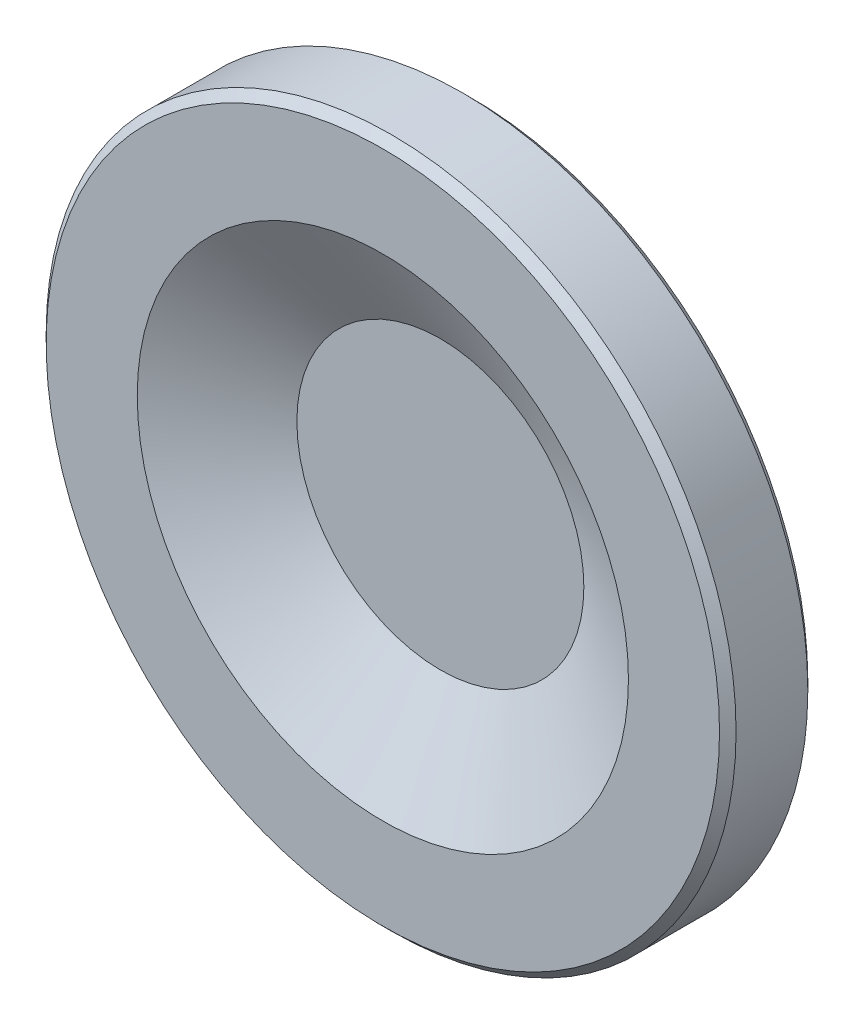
ISO-10303-21;
HEADER;
FILE_DESCRIPTION(('STEP AP214'),'2;1');
FILE_NAME('part.step','',(''),(''),'','','');
FILE_SCHEMA(('AUTOMOTIVE_DESIGN { 1 0 10303 214 1 1 1 1 }'));
ENDSEC;
DATA;
#1=APPLICATION_CONTEXT('core data for automotive mechanical design processes');
#2=APPLICATION_PROTOCOL_DEFINITION('international standard','automotive_design',2000,#1);
#3=PRODUCT_CONTEXT('',#1,'mechanical');
#4=PRODUCT('Part','Part','',(#3));
#5=PRODUCT_RELATED_PRODUCT_CATEGORY('part','',(#4));
#6=PRODUCT_DEFINITION_FORMATION('','',#4);
#7=PRODUCT_DEFINITION_CONTEXT('part definition',#1,'design');
#8=PRODUCT_DEFINITION('design','',#6,#7);
#9=PRODUCT_DEFINITION_SHAPE('','',#8);
#10=(LENGTH_UNIT() NAMED_UNIT(*) SI_UNIT(.MILLI.,.METRE.));
#11=(NAMED_UNIT(*) PLANE_ANGLE_UNIT() SI_UNIT($,.RADIAN.));
#12=(NAMED_UNIT(*) SI_UNIT($,.STERADIAN.) SOLID_ANGLE_UNIT());
#13=UNCERTAINTY_MEASURE_WITH_UNIT(LENGTH_MEASURE(1.E-05),#10,'distance_accuracy_value','');
#14=(GEOMETRIC_REPRESENTATION_CONTEXT(3) GLOBAL_UNCERTAINTY_ASSIGNED_CONTEXT((#13)) GLOBAL_UNIT_ASSIGNED_CONTEXT((#10,
#11,#12)) REPRESENTATION_CONTEXT('',''));
#15=CARTESIAN_POINT('',(0.,0.,0.));
#16=DIRECTION('',(0.,0.,1.));
#17=DIRECTION('',(1.,0.,0.));
#18=AXIS2_PLACEMENT_3D('',#15,#16,#17);
#19=CARTESIAN_POINT('',(0.,0.,43.5));
#20=DIRECTION('',(0.,0.,-1.));
#21=DIRECTION('',(-1.,0.,0.));
#22=AXIS2_PLACEMENT_3D('',#19,#20,#21);
#23=CONICAL_SURFACE('',#22,62.5,0.785398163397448);
#24=CARTESIAN_POINT('',(0.,0.,45.));
#25=DIRECTION('',(0.,0.,1.));
#26=DIRECTION('',(1.,0.,0.));
#27=AXIS2_PLACEMENT_3D('',#24,#25,#26);
#28=CIRCLE('',#27,61.);
#29=CARTESIAN_POINT('',(61.,0.,45.));
#30=VERTEX_POINT('',#29);
#31=EDGE_CURVE('E8',#30,#30,#28,.T.);
#32=ORIENTED_EDGE('',*,*,#31,.F.);
#33=EDGE_LOOP('',(#32));
#34=FACE_BOUND('',#33,.T.);
#35=CARTESIAN_POINT('',(0.,0.,43.5));
#36=DIRECTION('',(0.,0.,1.));
#37=DIRECTION('',(1.,0.,0.));
#38=AXIS2_PLACEMENT_3D('',#35,#36,#37);
#39=CIRCLE('',#38,62.5);
#40=CARTESIAN_POINT('',(62.5,0.,43.5));
#41=VERTEX_POINT('',#40);
#42=EDGE_CURVE('E69',#41,#41,#39,.T.);
#43=ORIENTED_EDGE('',*,*,#42,.T.);
#44=EDGE_LOOP('',(#43));
#45=FACE_BOUND('',#44,.T.);
#46=ADVANCED_FACE('F13',(#34,#45),#23,.T.);
#47=CARTESIAN_POINT('',(0.,44.5,45.));
#48=DIRECTION('',(0.,0.,1.));
#49=DIRECTION('',(1.,0.,0.));
#50=AXIS2_PLACEMENT_3D('',#47,#48,#49);
#51=PLANE('',#50);
#52=ORIENTED_EDGE('',*,*,#31,.T.);
#53=EDGE_LOOP('',(#52));
#54=FACE_BOUND('',#53,.T.);
#55=CARTESIAN_POINT('',(0.,0.,45.));
#56=DIRECTION('',(0.,0.,1.));
#57=DIRECTION('',(1.,0.,0.));
#58=AXIS2_PLACEMENT_3D('',#55,#56,#57);
#59=CIRCLE('',#58,44.5);
#60=CARTESIAN_POINT('',(44.5,0.,45.));
#61=VERTEX_POINT('',#60);
#62=EDGE_CURVE('E20',#61,#61,#59,.T.);
#63=ORIENTED_EDGE('',*,*,#62,.F.);
#64=EDGE_LOOP('',(#63));
#65=FACE_BOUND('',#64,.T.);
#66=ADVANCED_FACE('F89',(#54,#65),#51,.T.);
#67=CARTESIAN_POINT('',(0.,0.,45.));
#68=DIRECTION('',(0.,0.,1.));
#69=DIRECTION('',(1.,0.,0.));
#70=AXIS2_PLACEMENT_3D('',#67,#68,#69);
#71=CONICAL_SURFACE('',#70,44.5,1.05777048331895);
#72=CARTESIAN_POINT('',(0.,0.,34.578246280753));
#73=DIRECTION('',(0.,0.,1.));
#74=DIRECTION('',(1.,0.,0.));
#75=AXIS2_PLACEMENT_3D('',#72,#73,#74);
#76=CIRCLE('',#75,26.);
#77=CARTESIAN_POINT('',(26.,0.,34.578246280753));
#78=VERTEX_POINT('',#77);
#79=EDGE_CURVE('E26',#78,#78,#76,.T.);
#80=ORIENTED_EDGE('',*,*,#79,.F.);
#81=EDGE_LOOP('',(#80));
#82=FACE_BOUND('',#81,.T.);
#83=ORIENTED_EDGE('',*,*,#62,.T.);
#84=EDGE_LOOP('',(#83));
#85=FACE_BOUND('',#84,.T.);
#86=ADVANCED_FACE('F95',(#82,#85),#71,.F.);
#87=CARTESIAN_POINT('',(0.,0.,34.578246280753));
#88=DIRECTION('',(0.,0.,1.));
#89=DIRECTION('',(1.,0.,0.));
#90=AXIS2_PLACEMENT_3D('',#87,#88,#89);
#91=PLANE('',#90);
#92=ORIENTED_EDGE('',*,*,#79,.T.);
#93=EDGE_LOOP('',(#92));
#94=FACE_BOUND('',#93,.T.);
#95=ADVANCED_FACE('F100',(#94),#91,.T.);
#96=CARTESIAN_POINT('',(0.,13.5,0.));
#97=DIRECTION('',(0.,0.,-1.));
#98=DIRECTION('',(-1.,0.,0.));
#99=AXIS2_PLACEMENT_3D('',#96,#97,#98);
#100=PLANE('',#99);
#101=CARTESIAN_POINT('',(0.,0.,0.));
#102=DIRECTION('',(0.,0.,1.));
#103=DIRECTION('',(1.,0.,0.));
#104=AXIS2_PLACEMENT_3D('',#101,#102,#103);
#105=CIRCLE('',#104,13.5);
#106=CARTESIAN_POINT('',(13.5,0.,0.));
#107=VERTEX_POINT('',#106);
#108=EDGE_CURVE('E31',#107,#107,#105,.T.);
#109=ORIENTED_EDGE('',*,*,#108,.F.);
#110=EDGE_LOOP('',(#109));
#111=FACE_BOUND('',#110,.T.);
#112=ADVANCED_FACE('F107',(#111),#100,.T.);
#113=CARTESIAN_POINT('',(0.,0.,1.));
#114=DIRECTION('',(0.,0.,1.));
#115=DIRECTION('',(1.,0.,0.));
#116=AXIS2_PLACEMENT_3D('',#113,#114,#115);
#117=CONICAL_SURFACE('',#116,14.5,0.785398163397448);
#118=ORIENTED_EDGE('',*,*,#108,.T.);
#119=EDGE_LOOP('',(#118));
#120=FACE_BOUND('',#119,.T.);
#121=CARTESIAN_POINT('',(0.,0.,1.));
#122=DIRECTION('',(0.,0.,1.));
#123=DIRECTION('',(1.,0.,0.));
#124=AXIS2_PLACEMENT_3D('',#121,#122,#123);
#125=CIRCLE('',#124,14.5);
#126=CARTESIAN_POINT('',(14.5,0.,1.));
#127=VERTEX_POINT('',#126);
#128=EDGE_CURVE('E37',#127,#127,#125,.T.);
#129=ORIENTED_EDGE('',*,*,#128,.F.);
#130=EDGE_LOOP('',(#129));
#131=FACE_BOUND('',#130,.T.);
#132=ADVANCED_FACE('F111',(#120,#131),#117,.T.);
#133=CARTESIAN_POINT('',(0.,0.,55.));
#134=DIRECTION('',(0.,0.,1.));
#135=DIRECTION('',(1.,0.,0.));
#136=AXIS2_PLACEMENT_3D('',#133,#134,#135);
#137=CYLINDRICAL_SURFACE('',#136,14.5);
#138=CARTESIAN_POINT('',(0.,0.,12.));
#139=DIRECTION('',(0.,0.,1.));
#140=DIRECTION('',(1.,0.,0.));
#141=AXIS2_PLACEMENT_3D('',#138,#139,#140);
#142=CIRCLE('',#141,14.5);
#143=CARTESIAN_POINT('',(14.5,0.,12.));
#144=VERTEX_POINT('',#143);
#145=EDGE_CURVE('E41',#144,#144,#142,.T.);
#146=ORIENTED_EDGE('',*,*,#145,.F.);
#147=EDGE_LOOP('',(#146));
#148=FACE_BOUND('',#147,.T.);
#149=ORIENTED_EDGE('',*,*,#128,.T.);
#150=EDGE_LOOP('',(#149));
#151=FACE_BOUND('',#150,.T.);
#152=ADVANCED_FACE('F115',(#148,#151),#137,.T.);
#153=CARTESIAN_POINT('',(0.,14.5,12.));
#154=DIRECTION('',(0.,0.,1.));
#155=DIRECTION('',(1.,0.,0.));
#156=AXIS2_PLACEMENT_3D('',#153,#154,#155);
#157=PLANE('',#156);
#158=CARTESIAN_POINT('',(0.,0.,12.));
#159=DIRECTION('',(0.,0.,1.));
#160=DIRECTION('',(1.,0.,0.));
#161=AXIS2_PLACEMENT_3D('',#158,#159,#160);
#162=CIRCLE('',#161,19.);
#163=CARTESIAN_POINT('',(19.,0.,12.));
#164=VERTEX_POINT('',#163);
#165=EDGE_CURVE('E45',#164,#164,#162,.T.);
#166=ORIENTED_EDGE('',*,*,#165,.F.);
#167=EDGE_LOOP('',(#166));
#168=FACE_BOUND('',#167,.T.);
#169=ORIENTED_EDGE('',*,*,#145,.T.);
#170=EDGE_LOOP('',(#169));
#171=FACE_BOUND('',#170,.T.);
#172=ADVANCED_FACE('F119',(#168,#171),#157,.F.);
#173=CARTESIAN_POINT('',(0.,0.,55.));
#174=DIRECTION('',(0.,0.,1.));
#175=DIRECTION('',(1.,0.,0.));
#176=AXIS2_PLACEMENT_3D('',#173,#174,#175);
#177=CYLINDRICAL_SURFACE('',#176,19.);
#178=CARTESIAN_POINT('',(0.,0.,17.186250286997));
#179=DIRECTION('',(0.,0.,1.));
#180=DIRECTION('',(1.,0.,0.));
#181=AXIS2_PLACEMENT_3D('',#178,#179,#180);
#182=CIRCLE('',#181,19.);
#183=CARTESIAN_POINT('',(19.,0.,17.186250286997));
#184=VERTEX_POINT('',#183);
#185=EDGE_CURVE('E49',#184,#184,#182,.T.);
#186=ORIENTED_EDGE('',*,*,#185,.F.);
#187=EDGE_LOOP('',(#186));
#188=FACE_BOUND('',#187,.T.);
#189=ORIENTED_EDGE('',*,*,#165,.T.);
#190=EDGE_LOOP('',(#189));
#191=FACE_BOUND('',#190,.T.);
#192=ADVANCED_FACE('F123',(#188,#191),#177,.T.);
#193=CARTESIAN_POINT('',(0.,0.,17.186250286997));
#194=DIRECTION('',(0.,0.,1.));
#195=DIRECTION('',(1.,0.,0.));
#196=AXIS2_PLACEMENT_3D('',#193,#194,#195);
#197=TOROIDAL_SURFACE('',#196,23.,4.);
#198=ORIENTED_EDGE('',*,*,#185,.T.);
#199=EDGE_LOOP('',(#198));
#200=FACE_BOUND('',#199,.T.);
#201=CARTESIAN_POINT('',(0.,0.,20.494553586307));
#202=DIRECTION('',(0.,0.,1.));
#203=DIRECTION('',(1.,0.,0.));
#204=AXIS2_PLACEMENT_3D('',#201,#202,#203);
#205=CIRCLE('',#204,20.7516385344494);
#206=CARTESIAN_POINT('',(20.7516385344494,0.,20.494553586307));
#207=VERTEX_POINT('',#206);
#208=EDGE_CURVE('E53',#207,#207,#205,.T.);
#209=ORIENTED_EDGE('',*,*,#208,.F.);
#210=EDGE_LOOP('',(#209));
#211=FACE_BOUND('',#210,.T.);
#212=ADVANCED_FACE('F127',(#200,#211),#197,.F.);
#213=CARTESIAN_POINT('',(0.,0.,29.));
#214=DIRECTION('',(0.,0.,1.));
#215=DIRECTION('',(1.,0.,0.));
#216=AXIS2_PLACEMENT_3D('',#213,#214,#215);
#217=CONICAL_SURFACE('',#216,33.2667954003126,0.973885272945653);
#218=ORIENTED_EDGE('',*,*,#208,.T.);
#219=EDGE_LOOP('',(#218));
#220=FACE_BOUND('',#219,.T.);
#221=CARTESIAN_POINT('',(0.,0.,29.));
#222=DIRECTION('',(0.,0.,1.));
#223=DIRECTION('',(1.,0.,0.));
#224=AXIS2_PLACEMENT_3D('',#221,#222,#223);
#225=CIRCLE('',#224,33.2667954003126);
#226=CARTESIAN_POINT('',(33.2667954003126,0.,29.));
#227=VERTEX_POINT('',#226);
#228=EDGE_CURVE('E57',#227,#227,#225,.T.);
#229=ORIENTED_EDGE('',*,*,#228,.F.);
#230=EDGE_LOOP('',(#229));
#231=FACE_BOUND('',#230,.T.);
#232=ADVANCED_FACE('F131',(#220,#231),#217,.T.);
#233=CARTESIAN_POINT('',(0.,61.,29.));
#234=DIRECTION('',(0.,0.,-1.));
#235=DIRECTION('',(-1.,0.,0.));
#236=AXIS2_PLACEMENT_3D('',#233,#234,#235);
#237=PLANE('',#236);
#238=ORIENTED_EDGE('',*,*,#228,.T.);
#239=EDGE_LOOP('',(#238));
#240=FACE_BOUND('',#239,.T.);
#241=CARTESIAN_POINT('',(0.,0.,29.));
#242=DIRECTION('',(0.,0.,1.));
#243=DIRECTION('',(1.,0.,0.));
#244=AXIS2_PLACEMENT_3D('',#241,#242,#243);
#245=CIRCLE('',#244,61.);
#246=CARTESIAN_POINT('',(61.,0.,29.));
#247=VERTEX_POINT('',#246);
#248=EDGE_CURVE('E61',#247,#247,#245,.T.);
#249=ORIENTED_EDGE('',*,*,#248,.F.);
#250=EDGE_LOOP('',(#249));
#251=FACE_BOUND('',#250,.T.);
#252=ADVANCED_FACE('F85',(#240,#251),#237,.T.);
#253=CARTESIAN_POINT('',(0.,0.,30.5));
#254=DIRECTION('',(0.,0.,1.));
#255=DIRECTION('',(1.,0.,0.));
#256=AXIS2_PLACEMENT_3D('',#253,#254,#255);
#257=CONICAL_SURFACE('',#256,62.5,0.785398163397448);
#258=ORIENTED_EDGE('',*,*,#248,.T.);
#259=EDGE_LOOP('',(#258));
#260=FACE_BOUND('',#259,.T.);
#261=CARTESIAN_POINT('',(0.,0.,30.5));
#262=DIRECTION('',(0.,0.,1.));
#263=DIRECTION('',(1.,0.,0.));
#264=AXIS2_PLACEMENT_3D('',#261,#262,#263);
#265=CIRCLE('',#264,62.5);
#266=CARTESIAN_POINT('',(62.5,0.,30.5));
#267=VERTEX_POINT('',#266);
#268=EDGE_CURVE('E65',#267,#267,#265,.T.);
#269=ORIENTED_EDGE('',*,*,#268,.F.);
#270=EDGE_LOOP('',(#269));
#271=FACE_BOUND('',#270,.T.);
#272=ADVANCED_FACE('F77',(#260,#271),#257,.T.);
#273=CARTESIAN_POINT('',(0.,0.,55.));
#274=DIRECTION('',(0.,0.,1.));
#275=DIRECTION('',(1.,0.,0.));
#276=AXIS2_PLACEMENT_3D('',#273,#274,#275);
#277=CYLINDRICAL_SURFACE('',#276,62.5);
#278=ORIENTED_EDGE('',*,*,#268,.T.);
#279=EDGE_LOOP('',(#278));
#280=FACE_BOUND('',#279,.T.);
#281=ORIENTED_EDGE('',*,*,#42,.F.);
#282=EDGE_LOOP('',(#281));
#283=FACE_BOUND('',#282,.T.);
#284=ADVANCED_FACE('F75',(#280,#283),#277,.T.);
#285=CLOSED_SHELL('',(#46,#66,#86,#95,#112,#132,#152,#172,#192,#212,#232,#252,#272,#284));
#286=MANIFOLD_SOLID_BREP('B1',#285);
#287=ADVANCED_BREP_SHAPE_REPRESENTATION('',(#18,#286),#14);
#288=SHAPE_DEFINITION_REPRESENTATION(#9,#287);
ENDSEC;
END-ISO-10303-21;
